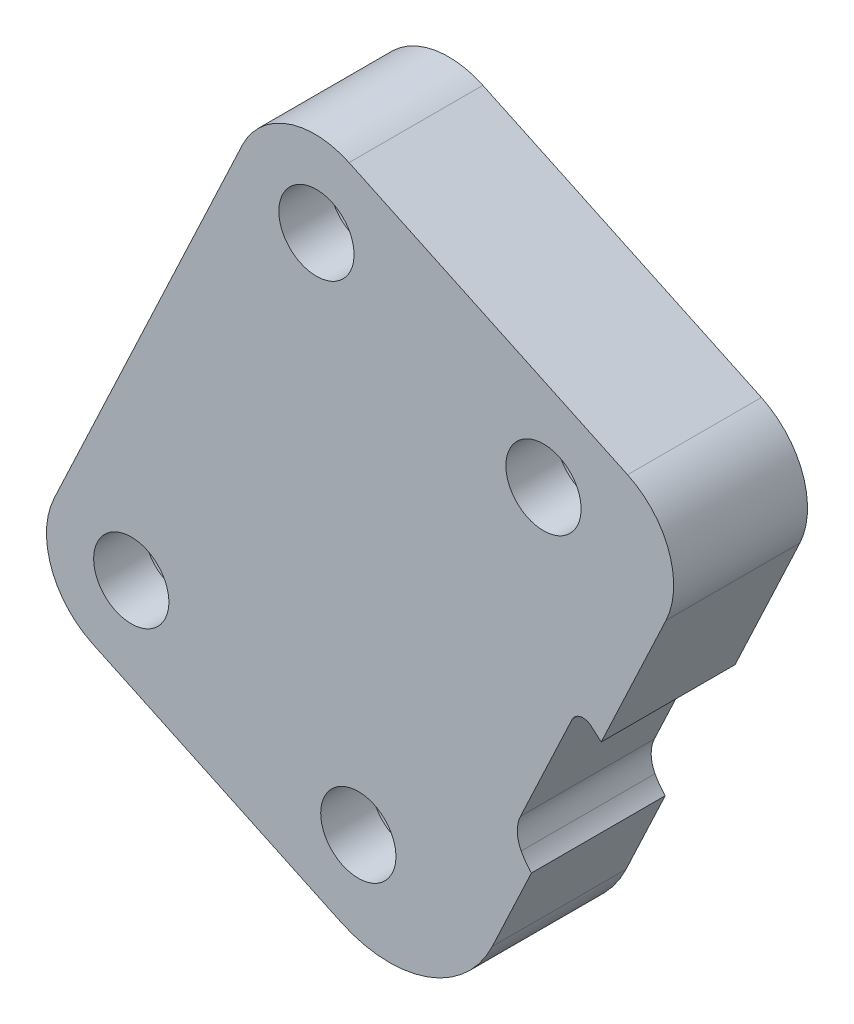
from build123d import *

# Parameters (mm, degrees)
BOSS_EXTRUDE1_DEPTH = 12.7
CUT_EXTRUDE1_DEPTH  = 409.034458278
HOLE1_D             = 7.1374
HOLE1_CBORE_D       = 10.7188
HOLE1_CBORE_DEPTH   = 7.874


with BuildPart() as part:
    # Sketch1 → Boss-Extrude1 (new body)
    with BuildSketch(Plane(origin=(0, 0, 3.2), x_dir=(-1, 0, 0), z_dir=(0, 0, -1))):
        with BuildLine():
            Line((347.024105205, 7.148413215), (363.516238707, -27.900263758))
            ThreePointArc((363.516238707, -27.900263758), (369.627103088, -33.460858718), (377.880071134, -33.07175948))
            Line((377.880071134, -33.07175948), (401.437378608, -21.986882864))
            ThreePointArc((401.437378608, -21.986882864), (405.362504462, -17.673331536), (405.087846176, -11.847707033))
            Line((405.087846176, -11.847707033), (387.243898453, 26.073812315))
            ThreePointArc((387.243898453, 26.073812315), (382.930347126, 29.99893817), (377.104722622, 29.724279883))
            Line((377.104722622, 29.724279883), (350.674572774, 17.287589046))
            ThreePointArc((350.674572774, 17.287589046), (346.749446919, 12.974037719), (347.024105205, 7.148413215))
        make_face()
    extrude(amount=-BOSS_EXTRUDE1_DEPTH)

    # Sketch2 → Cut-Extrude1 (cut, through all)
    with BuildSketch(Plane.XY.offset(28.6)):
        with BuildLine():
            Line((-360.833237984, -15.856891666), (-355.945050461, -5.468635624))
            ThreePointArc((-355.945050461, -5.468635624), (-355.134912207, -4.827505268), (-354.134813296, -5.086685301))
            Line((-354.134813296, -5.086685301), (-351.158147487, -7.671708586))
            Line((-351.158147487, -7.671708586), (-353.543431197, -21.300950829))
            ThreePointArc((-353.543431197, -21.300950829), (-357.660996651, -21.380910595), (-360.767207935, -18.676804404))
            ThreePointArc((-360.767207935, -18.676804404), (-361.132751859, -17.274634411), (-360.833237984, -15.856891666))
        make_face()
    extrude(amount=-CUT_EXTRUDE1_DEPTH, mode=Mode.SUBTRACT)

    # Hole1 (through all)
    with Locations(Plane(origin=(-303.713968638, 30.753051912, 3.2), x_dir=(-1, 0, 0), z_dir=(0, 0, -1))):
        with Locations((76.4830053, -8.346059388), (72.510272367, -55.831616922), (94.056590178, -45.693010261), (54.936687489, -18.484666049)):
            CounterBoreHole(HOLE1_D / 2, HOLE1_CBORE_D / 2, HOLE1_CBORE_DEPTH)


solid = part.part
